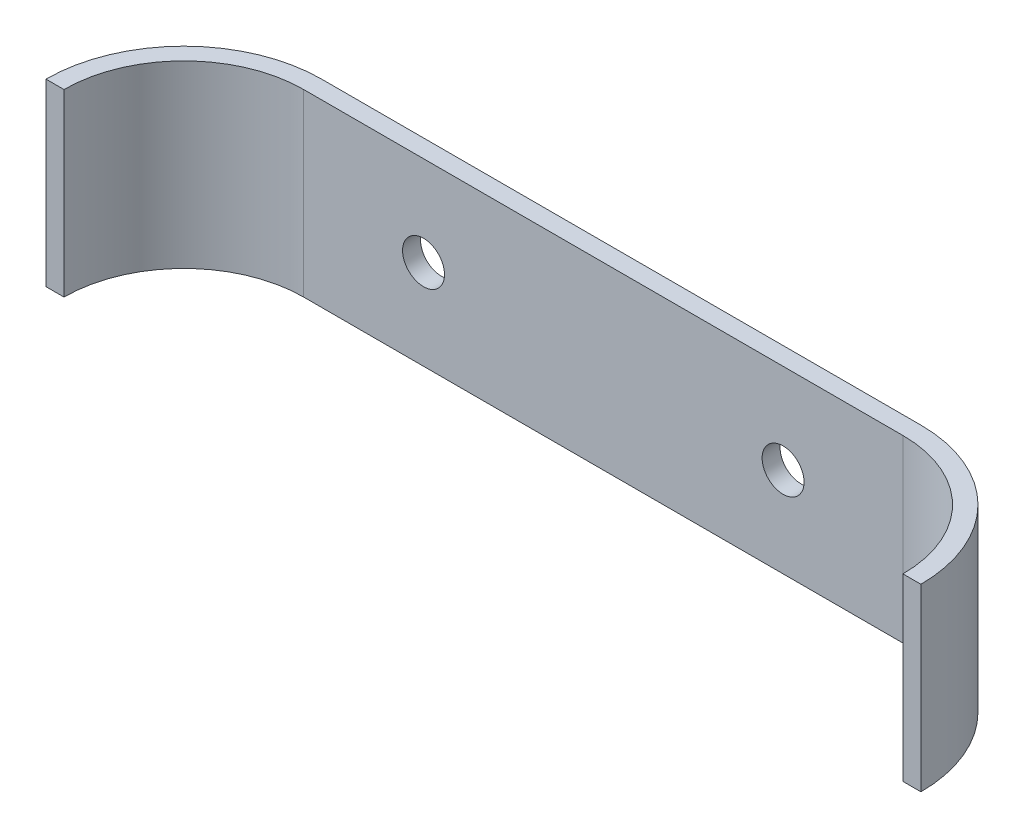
ISO-10303-21;
HEADER;
FILE_DESCRIPTION(('STEP AP214'),'2;1');
FILE_NAME('part.step','',(''),(''),'','','');
FILE_SCHEMA(('AUTOMOTIVE_DESIGN { 1 0 10303 214 1 1 1 1 }'));
ENDSEC;
DATA;
#1=APPLICATION_CONTEXT('core data for automotive mechanical design processes');
#2=APPLICATION_PROTOCOL_DEFINITION('international standard','automotive_design',2000,#1);
#3=PRODUCT_CONTEXT('',#1,'mechanical');
#4=PRODUCT('Part','Part','',(#3));
#5=PRODUCT_RELATED_PRODUCT_CATEGORY('part','',(#4));
#6=PRODUCT_DEFINITION_FORMATION('','',#4);
#7=PRODUCT_DEFINITION_CONTEXT('part definition',#1,'design');
#8=PRODUCT_DEFINITION('design','',#6,#7);
#9=PRODUCT_DEFINITION_SHAPE('','',#8);
#10=(LENGTH_UNIT() NAMED_UNIT(*) SI_UNIT(.MILLI.,.METRE.));
#11=(NAMED_UNIT(*) PLANE_ANGLE_UNIT() SI_UNIT($,.RADIAN.));
#12=(NAMED_UNIT(*) SI_UNIT($,.STERADIAN.) SOLID_ANGLE_UNIT());
#13=UNCERTAINTY_MEASURE_WITH_UNIT(LENGTH_MEASURE(1.E-05),#10,'distance_accuracy_value','');
#14=(GEOMETRIC_REPRESENTATION_CONTEXT(3) GLOBAL_UNCERTAINTY_ASSIGNED_CONTEXT((#13)) GLOBAL_UNIT_ASSIGNED_CONTEXT((#10,
#11,#12)) REPRESENTATION_CONTEXT('',''));
#15=CARTESIAN_POINT('',(0.,0.,0.));
#16=DIRECTION('',(0.,0.,1.));
#17=DIRECTION('',(1.,0.,0.));
#18=AXIS2_PLACEMENT_3D('',#15,#16,#17);
#19=CARTESIAN_POINT('',(0.,15.,0.));
#20=DIRECTION('',(0.,-1.,0.));
#21=DIRECTION('',(0.,0.,-1.));
#22=AXIS2_PLACEMENT_3D('',#19,#20,#21);
#23=CYLINDRICAL_SURFACE('',#22,10.);
#24=CARTESIAN_POINT('',(0.,0.,0.));
#25=DIRECTION('',(0.,-1.,0.));
#26=DIRECTION('',(0.,0.,1.));
#27=AXIS2_PLACEMENT_3D('',#24,#25,#26);
#28=CIRCLE('',#27,10.);
#29=CARTESIAN_POINT('',(-10.,0.,0.));
#30=VERTEX_POINT('',#29);
#31=CARTESIAN_POINT('',(0.,0.,-10.));
#32=VERTEX_POINT('',#31);
#33=EDGE_CURVE('E127',#30,#32,#28,.T.);
#34=ORIENTED_EDGE('',*,*,#33,.T.);
#35=DIRECTION('',(0.,-1.,0.));
#36=VECTOR('',#35,1.);
#37=CARTESIAN_POINT('',(0.,15.,-10.));
#38=LINE('',#37,#36);
#39=CARTESIAN_POINT('',(0.,15.,-10.));
#40=VERTEX_POINT('',#39);
#41=EDGE_CURVE('E11',#40,#32,#38,.T.);
#42=ORIENTED_EDGE('',*,*,#41,.F.);
#43=CARTESIAN_POINT('',(0.,15.,0.));
#44=DIRECTION('',(0.,-1.,0.));
#45=DIRECTION('',(0.,0.,1.));
#46=AXIS2_PLACEMENT_3D('',#43,#44,#45);
#47=CIRCLE('',#46,10.);
#48=CARTESIAN_POINT('',(-10.,15.,0.));
#49=VERTEX_POINT('',#48);
#50=EDGE_CURVE('E142',#49,#40,#47,.T.);
#51=ORIENTED_EDGE('',*,*,#50,.F.);
#52=DIRECTION('',(0.,-1.,0.));
#53=VECTOR('',#52,1.);
#54=CARTESIAN_POINT('',(-10.,15.,0.));
#55=LINE('',#54,#53);
#56=EDGE_CURVE('E123',#49,#30,#55,.T.);
#57=ORIENTED_EDGE('',*,*,#56,.T.);
#58=EDGE_LOOP('',(#34,#42,#51,#57));
#59=FACE_BOUND('',#58,.T.);
#60=ADVANCED_FACE('F31',(#59),#23,.F.);
#61=CARTESIAN_POINT('',(0.,15.,-10.));
#62=DIRECTION('',(0.,0.,-1.));
#63=DIRECTION('',(-1.,0.,0.));
#64=AXIS2_PLACEMENT_3D('',#61,#62,#63);
#65=PLANE('',#64);
#66=CARTESIAN_POINT('',(40.,7.5,-10.));
#67=DIRECTION('',(0.,0.,1.));
#68=DIRECTION('',(1.,0.,0.));
#69=AXIS2_PLACEMENT_3D('',#66,#67,#68);
#70=CIRCLE('',#69,1.75);
#71=CARTESIAN_POINT('',(41.75,7.5,-10.));
#72=VERTEX_POINT('',#71);
#73=EDGE_CURVE('E181',#72,#72,#70,.T.);
#74=ORIENTED_EDGE('',*,*,#73,.F.);
#75=EDGE_LOOP('',(#74));
#76=FACE_BOUND('',#75,.T.);
#77=CARTESIAN_POINT('',(10.,7.5,-10.));
#78=DIRECTION('',(0.,0.,1.));
#79=DIRECTION('',(1.,0.,0.));
#80=AXIS2_PLACEMENT_3D('',#77,#78,#79);
#81=CIRCLE('',#80,1.75);
#82=CARTESIAN_POINT('',(11.75,7.5,-10.));
#83=VERTEX_POINT('',#82);
#84=EDGE_CURVE('E175',#83,#83,#81,.T.);
#85=ORIENTED_EDGE('',*,*,#84,.F.);
#86=EDGE_LOOP('',(#85));
#87=FACE_BOUND('',#86,.T.);
#88=DIRECTION('',(1.,0.,0.));
#89=VECTOR('',#88,1.);
#90=CARTESIAN_POINT('',(0.,0.,-10.));
#91=LINE('',#90,#89);
#92=CARTESIAN_POINT('',(50.,0.,-10.));
#93=VERTEX_POINT('',#92);
#94=EDGE_CURVE('E130',#32,#93,#91,.T.);
#95=ORIENTED_EDGE('',*,*,#94,.T.);
#96=DIRECTION('',(0.,-1.,0.));
#97=VECTOR('',#96,1.);
#98=CARTESIAN_POINT('',(50.,15.,-10.));
#99=LINE('',#98,#97);
#100=CARTESIAN_POINT('',(50.,15.,-10.));
#101=VERTEX_POINT('',#100);
#102=EDGE_CURVE('E39',#101,#93,#99,.T.);
#103=ORIENTED_EDGE('',*,*,#102,.F.);
#104=DIRECTION('',(1.,0.,0.));
#105=VECTOR('',#104,1.);
#106=CARTESIAN_POINT('',(0.,15.,-10.));
#107=LINE('',#106,#105);
#108=EDGE_CURVE('E90',#40,#101,#107,.T.);
#109=ORIENTED_EDGE('',*,*,#108,.F.);
#110=ORIENTED_EDGE('',*,*,#41,.T.);
#111=EDGE_LOOP('',(#95,#103,#109,#110));
#112=FACE_BOUND('',#111,.T.);
#113=ADVANCED_FACE('F196',(#76,#87,#112),#65,.F.);
#114=CARTESIAN_POINT('',(50.,15.,0.));
#115=DIRECTION('',(0.,-1.,0.));
#116=DIRECTION('',(0.,0.,-1.));
#117=AXIS2_PLACEMENT_3D('',#114,#115,#116);
#118=CYLINDRICAL_SURFACE('',#117,10.);
#119=CARTESIAN_POINT('',(50.,0.,0.));
#120=DIRECTION('',(0.,-1.,0.));
#121=DIRECTION('',(0.,0.,1.));
#122=AXIS2_PLACEMENT_3D('',#119,#120,#121);
#123=CIRCLE('',#122,10.);
#124=CARTESIAN_POINT('',(60.,0.,0.));
#125=VERTEX_POINT('',#124);
#126=EDGE_CURVE('E133',#93,#125,#123,.T.);
#127=ORIENTED_EDGE('',*,*,#126,.T.);
#128=DIRECTION('',(0.,-1.,0.));
#129=VECTOR('',#128,1.);
#130=CARTESIAN_POINT('',(60.,15.,0.));
#131=LINE('',#130,#129);
#132=CARTESIAN_POINT('',(60.,15.,0.));
#133=VERTEX_POINT('',#132);
#134=EDGE_CURVE('E149',#133,#125,#131,.T.);
#135=ORIENTED_EDGE('',*,*,#134,.F.);
#136=CARTESIAN_POINT('',(50.,15.,0.));
#137=DIRECTION('',(0.,-1.,0.));
#138=DIRECTION('',(0.,0.,1.));
#139=AXIS2_PLACEMENT_3D('',#136,#137,#138);
#140=CIRCLE('',#139,10.);
#141=EDGE_CURVE('E157',#101,#133,#140,.T.);
#142=ORIENTED_EDGE('',*,*,#141,.F.);
#143=ORIENTED_EDGE('',*,*,#102,.T.);
#144=EDGE_LOOP('',(#127,#135,#142,#143));
#145=FACE_BOUND('',#144,.T.);
#146=ADVANCED_FACE('F155',(#145),#118,.F.);
#147=CARTESIAN_POINT('',(60.,15.,0.));
#148=DIRECTION('',(0.,0.,-1.));
#149=DIRECTION('',(-1.,0.,0.));
#150=AXIS2_PLACEMENT_3D('',#147,#148,#149);
#151=PLANE('',#150);
#152=DIRECTION('',(1.,0.,0.));
#153=VECTOR('',#152,1.);
#154=CARTESIAN_POINT('',(60.,0.,0.));
#155=LINE('',#154,#153);
#156=CARTESIAN_POINT('',(61.5,0.,0.));
#157=VERTEX_POINT('',#156);
#158=EDGE_CURVE('E135',#125,#157,#155,.T.);
#159=ORIENTED_EDGE('',*,*,#158,.T.);
#160=DIRECTION('',(0.,-1.,0.));
#161=VECTOR('',#160,1.);
#162=CARTESIAN_POINT('',(61.5,15.,0.));
#163=LINE('',#162,#161);
#164=CARTESIAN_POINT('',(61.5,15.,0.));
#165=VERTEX_POINT('',#164);
#166=EDGE_CURVE('E146',#165,#157,#163,.T.);
#167=ORIENTED_EDGE('',*,*,#166,.F.);
#168=DIRECTION('',(1.,0.,0.));
#169=VECTOR('',#168,1.);
#170=CARTESIAN_POINT('',(60.,15.,0.));
#171=LINE('',#170,#169);
#172=EDGE_CURVE('E169',#133,#165,#171,.T.);
#173=ORIENTED_EDGE('',*,*,#172,.F.);
#174=ORIENTED_EDGE('',*,*,#134,.T.);
#175=EDGE_LOOP('',(#159,#167,#173,#174));
#176=FACE_BOUND('',#175,.T.);
#177=ADVANCED_FACE('F165',(#176),#151,.F.);
#178=CARTESIAN_POINT('',(50.,15.,0.));
#179=DIRECTION('',(0.,-1.,0.));
#180=DIRECTION('',(0.,0.,-1.));
#181=AXIS2_PLACEMENT_3D('',#178,#179,#180);
#182=CYLINDRICAL_SURFACE('',#181,11.5);
#183=CARTESIAN_POINT('',(50.,0.,0.));
#184=DIRECTION('',(0.,1.,0.));
#185=DIRECTION('',(0.,0.,1.));
#186=AXIS2_PLACEMENT_3D('',#183,#184,#185);
#187=CIRCLE('',#186,11.5);
#188=CARTESIAN_POINT('',(50.,0.,-11.5));
#189=VERTEX_POINT('',#188);
#190=EDGE_CURVE('E137',#157,#189,#187,.T.);
#191=ORIENTED_EDGE('',*,*,#190,.T.);
#192=DIRECTION('',(0.,-1.,0.));
#193=VECTOR('',#192,1.);
#194=CARTESIAN_POINT('',(50.,15.,-11.5));
#195=LINE('',#194,#193);
#196=CARTESIAN_POINT('',(50.,15.,-11.5));
#197=VERTEX_POINT('',#196);
#198=EDGE_CURVE('E118',#197,#189,#195,.T.);
#199=ORIENTED_EDGE('',*,*,#198,.F.);
#200=CARTESIAN_POINT('',(50.,15.,0.));
#201=DIRECTION('',(0.,1.,0.));
#202=DIRECTION('',(0.,0.,1.));
#203=AXIS2_PLACEMENT_3D('',#200,#201,#202);
#204=CIRCLE('',#203,11.5);
#205=EDGE_CURVE('E109',#165,#197,#204,.T.);
#206=ORIENTED_EDGE('',*,*,#205,.F.);
#207=ORIENTED_EDGE('',*,*,#166,.T.);
#208=EDGE_LOOP('',(#191,#199,#206,#207));
#209=FACE_BOUND('',#208,.T.);
#210=ADVANCED_FACE('F168',(#209),#182,.T.);
#211=CARTESIAN_POINT('',(0.,15.,-11.5));
#212=DIRECTION('',(0.,0.,1.));
#213=DIRECTION('',(1.,0.,0.));
#214=AXIS2_PLACEMENT_3D('',#211,#212,#213);
#215=PLANE('',#214);
#216=CARTESIAN_POINT('',(40.,7.5,-11.5));
#217=DIRECTION('',(0.,0.,1.));
#218=DIRECTION('',(1.,0.,0.));
#219=AXIS2_PLACEMENT_3D('',#216,#217,#218);
#220=CIRCLE('',#219,1.75);
#221=CARTESIAN_POINT('',(41.75,7.5,-11.5));
#222=VERTEX_POINT('',#221);
#223=EDGE_CURVE('E178',#222,#222,#220,.T.);
#224=ORIENTED_EDGE('',*,*,#223,.T.);
#225=EDGE_LOOP('',(#224));
#226=FACE_BOUND('',#225,.T.);
#227=CARTESIAN_POINT('',(10.,7.5,-11.5));
#228=DIRECTION('',(0.,0.,1.));
#229=DIRECTION('',(1.,0.,0.));
#230=AXIS2_PLACEMENT_3D('',#227,#228,#229);
#231=CIRCLE('',#230,1.75);
#232=CARTESIAN_POINT('',(11.75,7.5,-11.5));
#233=VERTEX_POINT('',#232);
#234=EDGE_CURVE('E131',#233,#233,#231,.T.);
#235=ORIENTED_EDGE('',*,*,#234,.T.);
#236=EDGE_LOOP('',(#235));
#237=FACE_BOUND('',#236,.T.);
#238=DIRECTION('',(-1.,0.,0.));
#239=VECTOR('',#238,1.);
#240=CARTESIAN_POINT('',(0.,0.,-11.5));
#241=LINE('',#240,#239);
#242=CARTESIAN_POINT('',(0.,0.,-11.5));
#243=VERTEX_POINT('',#242);
#244=EDGE_CURVE('E117',#189,#243,#241,.T.);
#245=ORIENTED_EDGE('',*,*,#244,.T.);
#246=DIRECTION('',(0.,-1.,0.));
#247=VECTOR('',#246,1.);
#248=CARTESIAN_POINT('',(0.,15.,-11.5));
#249=LINE('',#248,#247);
#250=CARTESIAN_POINT('',(0.,15.,-11.5));
#251=VERTEX_POINT('',#250);
#252=EDGE_CURVE('E114',#251,#243,#249,.T.);
#253=ORIENTED_EDGE('',*,*,#252,.F.);
#254=DIRECTION('',(-1.,0.,0.));
#255=VECTOR('',#254,1.);
#256=CARTESIAN_POINT('',(0.,15.,-11.5));
#257=LINE('',#256,#255);
#258=EDGE_CURVE('E103',#197,#251,#257,.T.);
#259=ORIENTED_EDGE('',*,*,#258,.F.);
#260=ORIENTED_EDGE('',*,*,#198,.T.);
#261=EDGE_LOOP('',(#245,#253,#259,#260));
#262=FACE_BOUND('',#261,.T.);
#263=ADVANCED_FACE('F115',(#226,#237,#262),#215,.F.);
#264=CARTESIAN_POINT('',(0.,15.,0.));
#265=DIRECTION('',(0.,-1.,0.));
#266=DIRECTION('',(0.,0.,-1.));
#267=AXIS2_PLACEMENT_3D('',#264,#265,#266);
#268=CYLINDRICAL_SURFACE('',#267,11.5);
#269=CARTESIAN_POINT('',(0.,0.,0.));
#270=DIRECTION('',(0.,1.,0.));
#271=DIRECTION('',(0.,0.,1.));
#272=AXIS2_PLACEMENT_3D('',#269,#270,#271);
#273=CIRCLE('',#272,11.5);
#274=CARTESIAN_POINT('',(-11.5,0.,0.));
#275=VERTEX_POINT('',#274);
#276=EDGE_CURVE('E76',#243,#275,#273,.T.);
#277=ORIENTED_EDGE('',*,*,#276,.T.);
#278=DIRECTION('',(0.,-1.,0.));
#279=VECTOR('',#278,1.);
#280=CARTESIAN_POINT('',(-11.5,15.,0.));
#281=LINE('',#280,#279);
#282=CARTESIAN_POINT('',(-11.5,15.,0.));
#283=VERTEX_POINT('',#282);
#284=EDGE_CURVE('E119',#283,#275,#281,.T.);
#285=ORIENTED_EDGE('',*,*,#284,.F.);
#286=CARTESIAN_POINT('',(0.,15.,0.));
#287=DIRECTION('',(0.,1.,0.));
#288=DIRECTION('',(0.,0.,1.));
#289=AXIS2_PLACEMENT_3D('',#286,#287,#288);
#290=CIRCLE('',#289,11.5);
#291=EDGE_CURVE('E107',#251,#283,#290,.T.);
#292=ORIENTED_EDGE('',*,*,#291,.F.);
#293=ORIENTED_EDGE('',*,*,#252,.T.);
#294=EDGE_LOOP('',(#277,#285,#292,#293));
#295=FACE_BOUND('',#294,.T.);
#296=ADVANCED_FACE('F121',(#295),#268,.T.);
#297=CARTESIAN_POINT('',(-11.5,15.,0.));
#298=DIRECTION('',(0.,0.,-1.));
#299=DIRECTION('',(-1.,0.,0.));
#300=AXIS2_PLACEMENT_3D('',#297,#298,#299);
#301=PLANE('',#300);
#302=DIRECTION('',(1.,0.,0.));
#303=VECTOR('',#302,1.);
#304=CARTESIAN_POINT('',(-11.5,0.,0.));
#305=LINE('',#304,#303);
#306=EDGE_CURVE('E82',#275,#30,#305,.T.);
#307=ORIENTED_EDGE('',*,*,#306,.T.);
#308=ORIENTED_EDGE('',*,*,#56,.F.);
#309=DIRECTION('',(1.,0.,0.));
#310=VECTOR('',#309,1.);
#311=CARTESIAN_POINT('',(-11.5,15.,0.));
#312=LINE('',#311,#310);
#313=EDGE_CURVE('E47',#283,#49,#312,.T.);
#314=ORIENTED_EDGE('',*,*,#313,.F.);
#315=ORIENTED_EDGE('',*,*,#284,.T.);
#316=EDGE_LOOP('',(#307,#308,#314,#315));
#317=FACE_BOUND('',#316,.T.);
#318=ADVANCED_FACE('F203',(#317),#301,.F.);
#319=CARTESIAN_POINT('',(0.,15.,0.));
#320=DIRECTION('',(0.,1.,0.));
#321=DIRECTION('',(0.,0.,1.));
#322=AXIS2_PLACEMENT_3D('',#319,#320,#321);
#323=PLANE('',#322);
#324=ORIENTED_EDGE('',*,*,#50,.T.);
#325=ORIENTED_EDGE('',*,*,#108,.T.);
#326=ORIENTED_EDGE('',*,*,#141,.T.);
#327=ORIENTED_EDGE('',*,*,#172,.T.);
#328=ORIENTED_EDGE('',*,*,#205,.T.);
#329=ORIENTED_EDGE('',*,*,#258,.T.);
#330=ORIENTED_EDGE('',*,*,#291,.T.);
#331=ORIENTED_EDGE('',*,*,#313,.T.);
#332=EDGE_LOOP('',(#324,#325,#326,#327,#328,#329,#330,#331));
#333=FACE_BOUND('',#332,.T.);
#334=ADVANCED_FACE('F105',(#333),#323,.T.);
#335=CARTESIAN_POINT('',(0.,0.,0.));
#336=DIRECTION('',(0.,1.,0.));
#337=DIRECTION('',(0.,0.,1.));
#338=AXIS2_PLACEMENT_3D('',#335,#336,#337);
#339=PLANE('',#338);
#340=ORIENTED_EDGE('',*,*,#33,.F.);
#341=ORIENTED_EDGE('',*,*,#306,.F.);
#342=ORIENTED_EDGE('',*,*,#276,.F.);
#343=ORIENTED_EDGE('',*,*,#244,.F.);
#344=ORIENTED_EDGE('',*,*,#190,.F.);
#345=ORIENTED_EDGE('',*,*,#158,.F.);
#346=ORIENTED_EDGE('',*,*,#126,.F.);
#347=ORIENTED_EDGE('',*,*,#94,.F.);
#348=EDGE_LOOP('',(#340,#341,#342,#343,#344,#345,#346,#347));
#349=FACE_BOUND('',#348,.T.);
#350=ADVANCED_FACE('F161',(#349),#339,.F.);
#351=CARTESIAN_POINT('',(10.,7.5,-11.5));
#352=DIRECTION('',(0.,0.,1.));
#353=DIRECTION('',(1.,0.,0.));
#354=AXIS2_PLACEMENT_3D('',#351,#352,#353);
#355=CYLINDRICAL_SURFACE('',#354,1.75);
#356=ORIENTED_EDGE('',*,*,#234,.F.);
#357=EDGE_LOOP('',(#356));
#358=FACE_BOUND('',#357,.T.);
#359=ORIENTED_EDGE('',*,*,#84,.T.);
#360=EDGE_LOOP('',(#359));
#361=FACE_BOUND('',#360,.T.);
#362=ADVANCED_FACE('F192',(#358,#361),#355,.F.);
#363=CARTESIAN_POINT('',(40.,7.5,-11.5));
#364=DIRECTION('',(0.,0.,1.));
#365=DIRECTION('',(1.,0.,0.));
#366=AXIS2_PLACEMENT_3D('',#363,#364,#365);
#367=CYLINDRICAL_SURFACE('',#366,1.75);
#368=ORIENTED_EDGE('',*,*,#223,.F.);
#369=EDGE_LOOP('',(#368));
#370=FACE_BOUND('',#369,.T.);
#371=ORIENTED_EDGE('',*,*,#73,.T.);
#372=EDGE_LOOP('',(#371));
#373=FACE_BOUND('',#372,.T.);
#374=ADVANCED_FACE('F189',(#370,#373),#367,.F.);
#375=CLOSED_SHELL('',(#60,#113,#146,#177,#210,#263,#296,#318,#334,#350,#362,#374));
#376=MANIFOLD_SOLID_BREP('B2',#375);
#377=ADVANCED_BREP_SHAPE_REPRESENTATION('',(#18,#376),#14);
#378=SHAPE_DEFINITION_REPRESENTATION(#9,#377);
ENDSEC;
END-ISO-10303-21;
